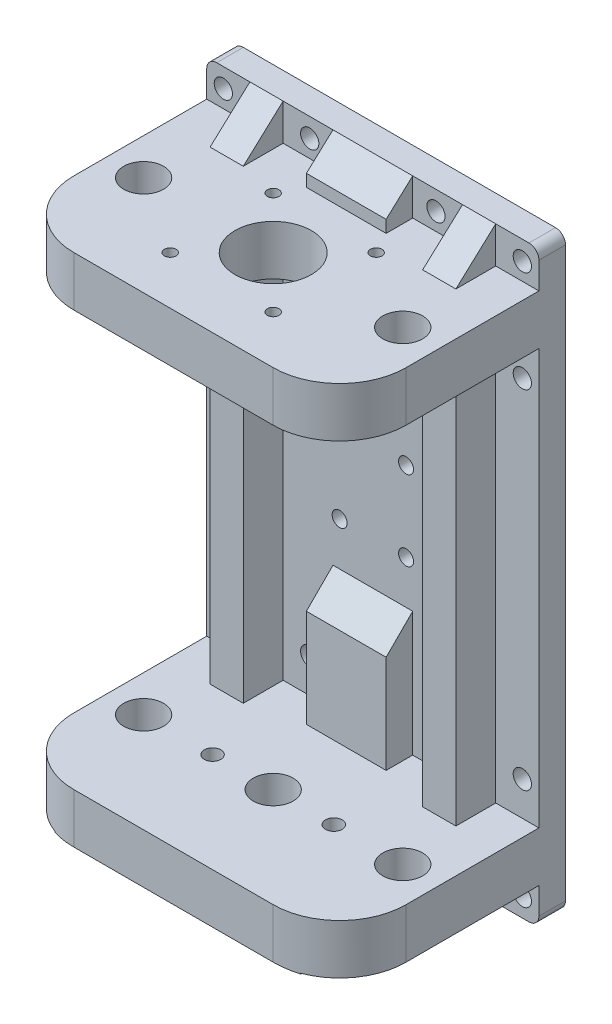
from build123d import *

# Parameters (mm, degrees)
CROQUIS1_W                 = 100
CROQUIS1_H                 = 177
CROQUIS1_R                 = 2.75
CROQUIS1_R_2               = 2.25
SALIENTE_EXTRUIR1_DEPTH    = 8
CROQUIS2_W                 = 100
CROQUIS2_H                 = 15
SALIENTE_EXTRUIR2_DEPTH    = 60
CROQUIS3_R                 = 11.5
CROQUIS3_R_2               = 6
CORTAR_EXTRUIR1_DEPTH      = 20
CROQUIS4_R                 = 6
CROQUIS4_R_2               = 5
CORTAR_EXTRUIR2_DEPTH      = 10
CROQUIS5_R                 = 2.5
CROQUIS5_R_2               = 6
CORTAR_EXTRUIR3_DEPTH      = 20
CORTAR_EXTRUIR4_DEPTH      = 6
REDONDEO2_R                = 20
SALIENTE_EXTRUIR4_REACH    = 672.425
CROQUIS8_W                 = 24
CROQUIS8_H                 = 8
CROQUIS8_W_2               = 10
CROQUIS8_H_2               = 12
CORTAR_EXTRUIR5_DEPTH      = 362.048997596
CORTAR_EXTRUIR5_DEPTH_BACK = 362.048997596
CORTAR_EXTRUIR6_DEPTH      = 24
SALIENTE_EXTRUIR5_DEPTH    = 11
CORTAR_EXTRUIR7_DEPTH      = 362.048997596
CORTAR_EXTRUIR7_DEPTH_BACK = 362.048997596
REDONDEO3_R                = 3
CROQUIS13_R                = 1.75
CORTAR_EXTRUIR8_DEPTH      = 15
CROQUIS14_R                = 3.5
CORTAR_EXTRUIR9_DEPTH      = 10


with BuildPart() as part:
    # Croquis1 → Saliente-Extruir1 (new body)
    with BuildSketch(Plane.XY):
        with Locations((-593.053130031, 255.24900533)):
            Rectangle(CROQUIS1_W, CROQUIS1_H)
        with Locations((-638.053130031, 337.99900533)):
            Circle(CROQUIS1_R, mode=Mode.SUBTRACT)
        with Locations((-612.053130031, 337.99900533)):
            Circle(CROQUIS1_R, mode=Mode.SUBTRACT)
        with Locations((-638.053130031, 307.49900533)):
            Circle(CROQUIS1_R, mode=Mode.SUBTRACT)
        with Locations((-612.053130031, 307.49900533)):
            Circle(CROQUIS1_R, mode=Mode.SUBTRACT)
        with Locations((-574.053130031, 337.99900533)):
            Circle(CROQUIS1_R, mode=Mode.SUBTRACT)
        with Locations((-548.053130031, 337.99900533)):
            Circle(CROQUIS1_R, mode=Mode.SUBTRACT)
        with Locations((-548.053130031, 307.49900533)):
            Circle(CROQUIS1_R, mode=Mode.SUBTRACT)
        with Locations((-574.053130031, 307.49900533)):
            Circle(CROQUIS1_R, mode=Mode.SUBTRACT)
        with Locations((-603.053130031, 267.299887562)):
            Circle(CROQUIS1_R_2, mode=Mode.SUBTRACT)
        with Locations((-583.053130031, 267.299887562)):
            Circle(CROQUIS1_R_2, mode=Mode.SUBTRACT)
        with Locations((-603.053130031, 243.299887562)):
            Circle(CROQUIS1_R_2, mode=Mode.SUBTRACT)
        with Locations((-583.053130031, 243.299887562)):
            Circle(CROQUIS1_R_2, mode=Mode.SUBTRACT)
        with Locations((-638.053130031, 202.99900533)):
            Circle(CROQUIS1_R, mode=Mode.SUBTRACT)
        with Locations((-612.053130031, 202.99900533)):
            Circle(CROQUIS1_R, mode=Mode.SUBTRACT)
        with Locations((-574.053130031, 202.99900533)):
            Circle(CROQUIS1_R, mode=Mode.SUBTRACT)
        with Locations((-548.053130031, 202.99900533)):
            Circle(CROQUIS1_R, mode=Mode.SUBTRACT)
        with Locations((-638.053130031, 172.49900533)):
            Circle(CROQUIS1_R, mode=Mode.SUBTRACT)
        with Locations((-612.053130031, 172.49900533)):
            Circle(CROQUIS1_R, mode=Mode.SUBTRACT)
        with Locations((-574.053130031, 172.49900533)):
            Circle(CROQUIS1_R, mode=Mode.SUBTRACT)
        with Locations((-548.053130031, 172.49900533)):
            Circle(CROQUIS1_R, mode=Mode.SUBTRACT)
    extrude(amount=SALIENTE_EXTRUIR1_DEPTH)

    # Croquis2 → Saliente-Extruir2 (add)
    with BuildSketch(Plane.XY.offset(8)):
        with Locations((-593.053130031, 325.24900533)):
            Rectangle(CROQUIS2_W, CROQUIS2_H)
        with Locations((-593.053130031, 185.24900533)):
            Rectangle(CROQUIS2_W, CROQUIS2_H)
    extrude(amount=SALIENTE_EXTRUIR2_DEPTH)

    # Croquis3 → Cortar-Extruir1 (cut)
    with BuildSketch(Plane(origin=(0, 332.74900533, 0), x_dir=(1, 0, 0), z_dir=(0, 1, 0))):
        with Locations(Location((-593.053130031, -38, 0), (0, 0, 270))):
            Circle(CROQUIS3_R)
        with Locations(Location((-554.053130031, -38, 0), (0, 0, 270))):
            Circle(CROQUIS3_R_2)
        with Locations(Location((-632.053130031, -38, 0), (0, 0, 270))):
            Circle(CROQUIS3_R_2)
    extrude(amount=-CORTAR_EXTRUIR1_DEPTH, mode=Mode.SUBTRACT)

    # Croquis4 → Cortar-Extruir2 (cut)
    with BuildSketch(Plane(origin=(0, 192.74900533, 0), x_dir=(1, 0, 0), z_dir=(0, 1, 0))):
        with Locations(Location((-554.053130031, -38, 0), (0, 0, 270))):
            Circle(CROQUIS4_R)
        with Locations(Location((-632.053130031, -38, 0), (0, 0, 270))):
            Circle(CROQUIS4_R)
        with Locations(Location((-593.053130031, -38, 0), (0, 0, 270))):
            Circle(CROQUIS4_R_2)
    extrude(amount=-CORTAR_EXTRUIR2_DEPTH, mode=Mode.SUBTRACT)

    # Croquis5 → Cortar-Extruir3 (cut)
    with BuildSketch(Plane(origin=(0, 192.74900533, 0), x_dir=(1, 0, 0), z_dir=(0, 1, 0))):
        with Locations(Location((-574.803130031, -38, 0), (0, 0, 270))):
            Circle(CROQUIS5_R)
        with Locations(Location((-611.303130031, -38, 0), (0, 0, 270))):
            Circle(CROQUIS5_R)
        with Locations(Location((-593.053130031, -38, 0), (0, 0, 270))):
            Circle(CROQUIS5_R_2)
    extrude(amount=-CORTAR_EXTRUIR3_DEPTH, mode=Mode.SUBTRACT)

    # Croquis6 → Cortar-Extruir4 (cut)
    with BuildSketch(Plane.XZ.offset(-177.74900533)):
        Polygon((-617.365307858, 38), (-614.334218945, 32.75), (-608.272041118, 32.75), (-605.240952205, 38), (-608.272041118, 43.25), (-614.334218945, 43.25), align=None)
        Polygon((-580.865307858, 38), (-577.834218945, 32.75), (-571.772041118, 32.75), (-568.740952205, 38), (-571.772041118, 43.25), (-577.834218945, 43.25), align=None)
    extrude(amount=-CORTAR_EXTRUIR4_DEPTH, mode=Mode.SUBTRACT)

    # Redondeo2
    redondeo2_edges = [part.edges().sort_by_distance(p)[0] for p in [
        (-643.053130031, 325.24900533, 68),
        (-543.053130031, 325.24900533, 68),
        (-643.053130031, 185.24900533, 68),
        (-543.053130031, 185.24900533, 68),
    ]]
    fillet(redondeo2_edges, radius=REDONDEO2_R)

    # Saliente-Extruir4: up to this face of the body (flat: up to its plane)
    saliente_extruir4_end = Plane(part.part.faces().sort_by_distance((-593.053130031, 166.74900533, 4))[0])
    # Croquis8 → Saliente-Extruir4 (add, up to the picked face)
    with BuildSketch(Plane(origin=(0, 343.74900533, 0), x_dir=(1, 0, 0), z_dir=(0, 1, 0)), mode=Mode.PRIVATE) as saliente_extruir4_sk1:
        with Locations((-593.053130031, -12)):
            Rectangle(CROQUIS8_W, CROQUIS8_H)
    saliente_extruir4_tool1 = split(extrude(saliente_extruir4_sk1.sketch, amount=-SALIENTE_EXTRUIR4_REACH, mode=Mode.PRIVATE), bisect_by=saliente_extruir4_end, keep=Keep.BOTH, mode=Mode.PRIVATE)
    # Croquis8 → Saliente-Extruir4 (add, up to the picked face)
    with BuildSketch(Plane(origin=(0, 343.74900533, 0), x_dir=(1, 0, 0), z_dir=(0, 1, 0)), mode=Mode.PRIVATE) as saliente_extruir4_sk2:
        with Locations((-625.053130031, -14)):
            Rectangle(CROQUIS8_W_2, CROQUIS8_H_2)
    saliente_extruir4_tool2 = split(extrude(saliente_extruir4_sk2.sketch, amount=-SALIENTE_EXTRUIR4_REACH, mode=Mode.PRIVATE), bisect_by=saliente_extruir4_end, keep=Keep.BOTH, mode=Mode.PRIVATE)
    # Croquis8 → Saliente-Extruir4 (add, up to the picked face)
    with BuildSketch(Plane(origin=(0, 343.74900533, 0), x_dir=(1, 0, 0), z_dir=(0, 1, 0)), mode=Mode.PRIVATE) as saliente_extruir4_sk3:
        with Locations((-561.053130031, -14)):
            Rectangle(CROQUIS8_W_2, CROQUIS8_H_2)
    saliente_extruir4_tool3 = split(extrude(saliente_extruir4_sk3.sketch, amount=-SALIENTE_EXTRUIR4_REACH, mode=Mode.PRIVATE), bisect_by=saliente_extruir4_end, keep=Keep.BOTH, mode=Mode.PRIVATE)
    add(saliente_extruir4_tool1.solids().sort_by(Axis((-593.05313, 343.749005, 12), (0, -1, 0)))[0])
    add(saliente_extruir4_tool2.solids().sort_by(Axis((-625.05313, 343.749005, 14), (0, -1, 0)))[0])
    add(saliente_extruir4_tool3.solids().sort_by(Axis((-561.05313, 343.749005, 14), (0, -1, 0)))[0])

    # Croquis9 → Cortar-Extruir5 (cut, two sides: drawn at the far end of the back side and taken through both)
    with BuildSketch(Plane.ZY.offset(630.053130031).offset(-CORTAR_EXTRUIR5_DEPTH_BACK)):
        Polygon((8, 343.74900533), (20, 332.74900533), (20, 343.74900533), align=None)
    extrude(amount=CORTAR_EXTRUIR5_DEPTH + CORTAR_EXTRUIR5_DEPTH_BACK, mode=Mode.SUBTRACT)

    # Croquis10 → Cortar-Extruir6 (cut)
    with BuildSketch(Plane.ZY.offset(605.053130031)):
        Polygon((20, 292.24900533), (8, 280.24900533), (8, 230.24900533), (20, 218.24900533), align=None)
    extrude(amount=-CORTAR_EXTRUIR6_DEPTH, mode=Mode.SUBTRACT)

    # Croquis11 → Saliente-Extruir5 (add)
    with BuildSketch(Plane.XZ.offset(-177.74900533)):
        with BuildLine():
            Line((-623.053130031, 68), (-620.053130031, 68))
            Line((-620.053130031, 68), (-620.053130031, 20))
            Line((-620.053130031, 20), (-630.053130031, 20))
            Line((-630.053130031, 20), (-630.053130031, 66.734993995))
            ThreePointArc((-630.053130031, 66.734993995), (-626.609822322, 67.681207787), (-623.053130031, 68))
        make_face()
        with BuildLine():
            Line((-566.053130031, 20), (-556.053130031, 20))
            Line((-556.053130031, 20), (-556.053130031, 66.734993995))
            ThreePointArc((-556.053130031, 66.734993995), (-559.496437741, 67.681207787), (-563.053130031, 68))
            Line((-563.053130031, 68), (-566.053130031, 68))
            Line((-566.053130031, 68), (-566.053130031, 20))
        make_face()
    extrude(amount=SALIENTE_EXTRUIR5_DEPTH)

    # Croquis12 → Cortar-Extruir7 (cut, two sides: drawn at the far end of the back side and taken through both)
    with BuildSketch(Plane.ZY.offset(630.053130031).offset(-CORTAR_EXTRUIR7_DEPTH_BACK)):
        Polygon((8, 166.74900533), (68, 177.74900533), (68, 166.74900533), align=None)
    extrude(amount=CORTAR_EXTRUIR7_DEPTH + CORTAR_EXTRUIR7_DEPTH_BACK, mode=Mode.SUBTRACT)

    # Redondeo3
    redondeo3_edges = [part.edges().sort_by_distance(p)[0] for p in [
        (-643.053130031, 343.74900533, 4),
        (-543.053130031, 343.74900533, 4),
        (-543.053130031, 166.74900533, 4),
        (-643.053130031, 166.74900533, 4),
    ]]
    fillet(redondeo3_edges, radius=REDONDEO3_R)

    # Croquis13 → Cortar-Extruir8 (cut)
    with BuildSketch(Plane(origin=(0, 332.74900533, 0), x_dir=(1, 0, 0), z_dir=(0, 1, 0))):
        with Locations(Location((-577.553130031, -53.5, 0), (0, 0, 270))):
            Circle(CROQUIS13_R)
        with Locations(Location((-577.553130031, -22.5, 0), (0, 0, 270))):
            Circle(CROQUIS13_R)
        with Locations(Location((-608.553130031, -53.5, 0), (0, 0, 270))):
            Circle(CROQUIS13_R)
        with Locations(Location((-608.553130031, -22.5, 0), (0, 0, 270))):
            Circle(CROQUIS13_R)
    extrude(amount=-CORTAR_EXTRUIR8_DEPTH, mode=Mode.SUBTRACT)

    # Croquis14 → Cortar-Extruir9 (cut)
    with BuildSketch(Plane.XZ.offset(-317.74900533)):
        with Locations(Location((-608.553130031, 22.5, 0), (0, 0, 270))):
            Circle(CROQUIS14_R)
        with Locations(Location((-608.553130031, 53.5, 0), (0, 0, 270))):
            Circle(CROQUIS14_R)
        with Locations(Location((-577.553130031, 53.5, 0), (0, 0, 270))):
            Circle(CROQUIS14_R)
        with Locations(Location((-577.553130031, 22.5, 0), (0, 0, 270))):
            Circle(CROQUIS14_R)
    extrude(amount=-CORTAR_EXTRUIR9_DEPTH, mode=Mode.SUBTRACT)


solid = part.part
